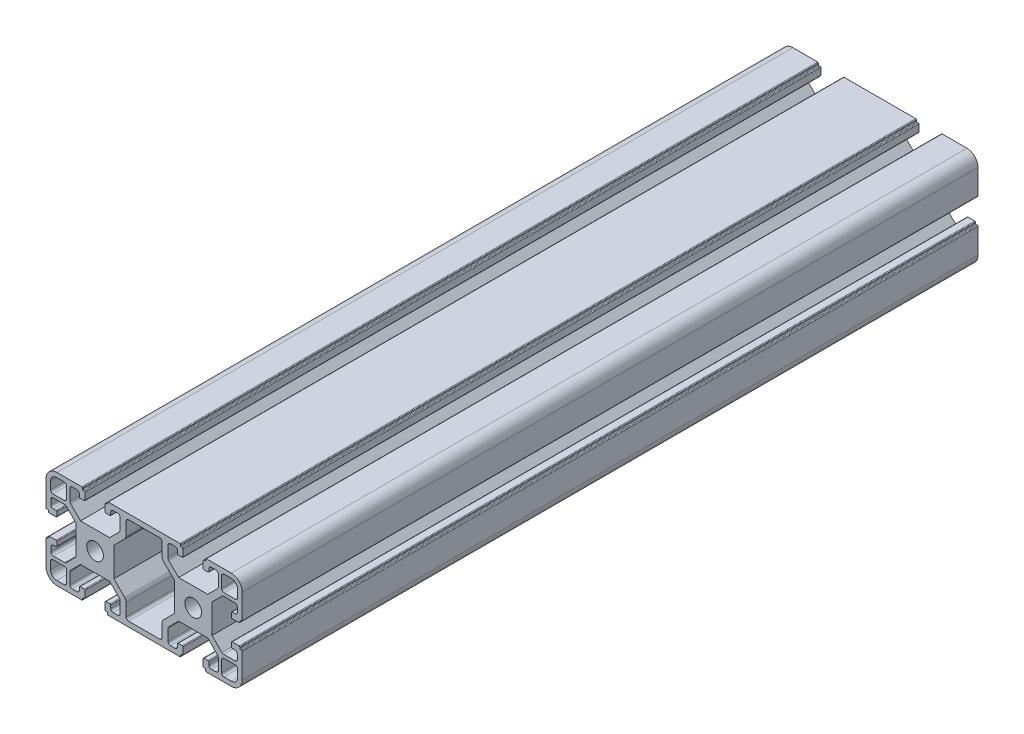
from build123d import *

# Parameters (mm, degrees)
MODEL_R         = 3.4
EXTRUDE_1_DEPTH = 300


with BuildPart() as part:
    # Model → Extrude 1 (new body)
    with BuildSketch(Plane.XY):
        with BuildLine():
            Line((2332.821808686, 1245.295370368), (2328.796934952, 1241.270496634))
            Line((2328.796934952, 1241.270496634), (2328.796934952, 1229.40603054))
            Line((2328.796934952, 1229.40603054), (2332.821808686, 1225.381156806))
            ThreePointArc((2332.821808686, 1225.381156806), (2333.146232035, 1225.164384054), (2333.528915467, 1225.088263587))
            Line((2333.528915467, 1225.088263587), (2338.096934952, 1225.088263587))
            ThreePointArc((2338.096934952, 1225.088263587), (2338.804041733, 1225.381156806), (2339.096934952, 1226.088263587))
            Line((2339.096934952, 1226.088263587), (2339.096934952, 1227.938263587))
            ThreePointArc((2339.096934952, 1227.938263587), (2338.804041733, 1228.645370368), (2338.096934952, 1228.938263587))
            Line((2338.096934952, 1228.938263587), (2336.996934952, 1228.938263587))
            ThreePointArc((2336.996934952, 1228.938263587), (2336.784802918, 1229.026131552), (2336.696934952, 1229.238263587))
            Line((2336.696934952, 1229.238263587), (2336.696934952, 1230.938263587))
            ThreePointArc((2336.696934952, 1230.938263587), (2336.784802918, 1231.150395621), (2336.996934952, 1231.238263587))
            Line((2336.996934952, 1231.238263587), (2339.796934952, 1231.238263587))
            ThreePointArc((2339.796934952, 1231.238263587), (2340.009066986, 1231.150395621), (2340.096934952, 1230.938263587))
            Line((2340.096934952, 1230.938263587), (2340.096934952, 1230.538263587))
            ThreePointArc((2340.096934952, 1230.538263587), (2340.184802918, 1230.326131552), (2340.396934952, 1230.238263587))
            Line((2340.396934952, 1230.238263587), (2340.796934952, 1230.238263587))
            ThreePointArc((2340.796934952, 1230.238263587), (2341.009066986, 1230.150395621), (2341.096934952, 1229.938263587))
            Line((2341.096934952, 1229.938263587), (2341.096934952, 1219.838263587))
            ThreePointArc((2341.096934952, 1219.838263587), (2339.778915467, 1216.656283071), (2336.596934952, 1215.338263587))
            Line((2336.596934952, 1215.338263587), (2326.496934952, 1215.338263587))
            ThreePointArc((2326.496934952, 1215.338263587), (2326.284802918, 1215.426131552), (2326.196934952, 1215.638263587))
            Line((2326.196934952, 1215.638263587), (2326.196934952, 1216.038263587))
            ThreePointArc((2326.196934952, 1216.038263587), (2326.109066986, 1216.250395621), (2325.896934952, 1216.338263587))
            Line((2325.896934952, 1216.338263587), (2325.496934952, 1216.338263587))
            ThreePointArc((2325.496934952, 1216.338263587), (2325.284802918, 1216.426131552), (2325.196934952, 1216.638263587))
            Line((2325.196934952, 1216.638263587), (2325.196934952, 1219.438263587))
            ThreePointArc((2325.196934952, 1219.438263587), (2325.284802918, 1219.650395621), (2325.496934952, 1219.738263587))
            Line((2325.496934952, 1219.738263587), (2327.196934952, 1219.738263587))
            ThreePointArc((2327.196934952, 1219.738263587), (2327.409066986, 1219.650395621), (2327.496934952, 1219.438263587))
            Line((2327.496934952, 1219.438263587), (2327.496934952, 1218.338263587))
            ThreePointArc((2327.496934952, 1218.338263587), (2327.789828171, 1217.631156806), (2328.496934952, 1217.338263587))
            Line((2328.496934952, 1217.338263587), (2330.346934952, 1217.338263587))
            ThreePointArc((2330.346934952, 1217.338263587), (2331.054041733, 1217.631156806), (2331.346934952, 1218.338263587))
            Line((2331.346934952, 1218.338263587), (2331.346934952, 1222.906283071))
            ThreePointArc((2331.346934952, 1222.906283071), (2331.270814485, 1223.288966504), (2331.054041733, 1223.613389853))
            Line((2331.054041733, 1223.613389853), (2327.029167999, 1227.638263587))
            Line((2327.029167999, 1227.638263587), (2315.164701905, 1227.638263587))
            Line((2315.164701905, 1227.638263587), (2311.139828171, 1223.613389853))
            ThreePointArc((2311.139828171, 1223.613389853), (2310.92305542, 1223.288966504), (2310.846934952, 1222.906283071))
            Line((2310.846934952, 1222.906283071), (2310.846934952, 1218.338263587))
            ThreePointArc((2310.846934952, 1218.338263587), (2311.139828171, 1217.631156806), (2311.846934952, 1217.338263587))
            Line((2311.846934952, 1217.338263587), (2313.696934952, 1217.338263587))
            ThreePointArc((2313.696934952, 1217.338263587), (2314.404041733, 1217.631156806), (2314.696934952, 1218.338263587))
            Line((2314.696934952, 1218.338263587), (2314.696934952, 1219.438263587))
            ThreePointArc((2314.696934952, 1219.438263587), (2314.784802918, 1219.650395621), (2314.996934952, 1219.738263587))
            Line((2314.996934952, 1219.738263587), (2316.696934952, 1219.738263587))
            ThreePointArc((2316.696934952, 1219.738263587), (2316.909066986, 1219.650395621), (2316.996934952, 1219.438263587))
            Line((2316.996934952, 1219.438263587), (2316.996934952, 1216.638263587))
            ThreePointArc((2316.996934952, 1216.638263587), (2316.909066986, 1216.426131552), (2316.696934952, 1216.338263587))
            Line((2316.696934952, 1216.338263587), (2316.296934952, 1216.338263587))
            ThreePointArc((2316.296934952, 1216.338263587), (2316.084802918, 1216.250395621), (2315.996934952, 1216.038263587))
            Line((2315.996934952, 1216.038263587), (2315.996934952, 1215.638263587))
            ThreePointArc((2315.996934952, 1215.638263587), (2315.909066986, 1215.426131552), (2315.696934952, 1215.338263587))
            Line((2315.696934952, 1215.338263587), (2286.496934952, 1215.338263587))
            ThreePointArc((2286.496934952, 1215.338263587), (2286.284802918, 1215.426131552), (2286.196934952, 1215.638263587))
            Line((2286.196934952, 1215.638263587), (2286.196934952, 1216.038263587))
            ThreePointArc((2286.196934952, 1216.038263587), (2286.109066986, 1216.250395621), (2285.896934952, 1216.338263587))
            Line((2285.896934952, 1216.338263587), (2285.496934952, 1216.338263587))
            ThreePointArc((2285.496934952, 1216.338263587), (2285.284802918, 1216.426131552), (2285.196934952, 1216.638263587))
            Line((2285.196934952, 1216.638263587), (2285.196934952, 1219.438263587))
            ThreePointArc((2285.196934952, 1219.438263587), (2285.284802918, 1219.650395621), (2285.496934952, 1219.738263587))
            Line((2285.496934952, 1219.738263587), (2287.196934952, 1219.738263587))
            ThreePointArc((2287.196934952, 1219.738263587), (2287.409066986, 1219.650395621), (2287.496934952, 1219.438263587))
            Line((2287.496934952, 1219.438263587), (2287.496934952, 1218.338263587))
            ThreePointArc((2287.496934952, 1218.338263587), (2287.789828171, 1217.631156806), (2288.496934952, 1217.338263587))
            Line((2288.496934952, 1217.338263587), (2290.346934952, 1217.338263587))
            ThreePointArc((2290.346934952, 1217.338263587), (2291.054041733, 1217.631156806), (2291.346934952, 1218.338263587))
            Line((2291.346934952, 1218.338263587), (2291.346934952, 1222.906283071))
            ThreePointArc((2291.346934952, 1222.906283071), (2291.270814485, 1223.288966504), (2291.054041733, 1223.613389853))
            Line((2291.054041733, 1223.613389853), (2287.029167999, 1227.638263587))
            Line((2287.029167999, 1227.638263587), (2275.164701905, 1227.638263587))
            Line((2275.164701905, 1227.638263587), (2271.139828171, 1223.613389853))
            ThreePointArc((2271.139828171, 1223.613389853), (2270.92305542, 1223.288966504), (2270.846934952, 1222.906283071))
            Line((2270.846934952, 1222.906283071), (2270.846934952, 1218.338263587))
            ThreePointArc((2270.846934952, 1218.338263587), (2271.139828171, 1217.631156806), (2271.846934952, 1217.338263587))
            Line((2271.846934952, 1217.338263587), (2273.696934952, 1217.338263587))
            ThreePointArc((2273.696934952, 1217.338263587), (2274.404041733, 1217.631156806), (2274.696934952, 1218.338263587))
            Line((2274.696934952, 1218.338263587), (2274.696934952, 1219.438263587))
            ThreePointArc((2274.696934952, 1219.438263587), (2274.784802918, 1219.650395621), (2274.996934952, 1219.738263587))
            Line((2274.996934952, 1219.738263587), (2276.696934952, 1219.738263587))
            ThreePointArc((2276.696934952, 1219.738263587), (2276.909066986, 1219.650395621), (2276.996934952, 1219.438263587))
            Line((2276.996934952, 1219.438263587), (2276.996934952, 1216.638263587))
            ThreePointArc((2276.996934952, 1216.638263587), (2276.909066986, 1216.426131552), (2276.696934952, 1216.338263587))
            Line((2276.696934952, 1216.338263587), (2276.296934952, 1216.338263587))
            ThreePointArc((2276.296934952, 1216.338263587), (2276.084802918, 1216.250395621), (2275.996934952, 1216.038263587))
            Line((2275.996934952, 1216.038263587), (2275.996934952, 1215.638263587))
            ThreePointArc((2275.996934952, 1215.638263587), (2275.909066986, 1215.426131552), (2275.696934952, 1215.338263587))
            Line((2275.696934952, 1215.338263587), (2265.596934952, 1215.338263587))
            ThreePointArc((2265.596934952, 1215.338263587), (2262.414954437, 1216.656283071), (2261.096934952, 1219.838263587))
            Line((2261.096934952, 1219.838263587), (2261.096934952, 1229.938263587))
            ThreePointArc((2261.096934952, 1229.938263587), (2261.184802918, 1230.150395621), (2261.396934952, 1230.238263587))
            Line((2261.396934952, 1230.238263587), (2261.796934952, 1230.238263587))
            ThreePointArc((2261.796934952, 1230.238263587), (2262.009066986, 1230.326131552), (2262.096934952, 1230.538263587))
            Line((2262.096934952, 1230.538263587), (2262.096934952, 1230.938263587))
            ThreePointArc((2262.096934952, 1230.938263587), (2262.184802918, 1231.150395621), (2262.396934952, 1231.238263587))
            Line((2262.396934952, 1231.238263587), (2265.196934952, 1231.238263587))
            ThreePointArc((2265.196934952, 1231.238263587), (2265.409066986, 1231.150395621), (2265.496934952, 1230.938263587))
            Line((2265.496934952, 1230.938263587), (2265.496934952, 1229.238263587))
            ThreePointArc((2265.496934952, 1229.238263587), (2265.409066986, 1229.026131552), (2265.196934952, 1228.938263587))
            Line((2265.196934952, 1228.938263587), (2264.096934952, 1228.938263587))
            ThreePointArc((2264.096934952, 1228.938263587), (2263.389828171, 1228.645370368), (2263.096934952, 1227.938263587))
            Line((2263.096934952, 1227.938263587), (2263.096934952, 1226.088263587))
            ThreePointArc((2263.096934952, 1226.088263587), (2263.389828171, 1225.381156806), (2264.096934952, 1225.088263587))
            Line((2264.096934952, 1225.088263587), (2268.664954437, 1225.088263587))
            ThreePointArc((2268.664954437, 1225.088263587), (2269.047637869, 1225.164384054), (2269.372061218, 1225.381156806))
            Line((2269.372061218, 1225.381156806), (2273.396934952, 1229.40603054))
            Line((2273.396934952, 1229.40603054), (2273.396934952, 1241.270496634))
            Line((2273.396934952, 1241.270496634), (2269.372061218, 1245.295370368))
            ThreePointArc((2269.372061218, 1245.295370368), (2269.047637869, 1245.512143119), (2268.664954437, 1245.588263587))
            Line((2268.664954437, 1245.588263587), (2264.096934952, 1245.588263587))
            ThreePointArc((2264.096934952, 1245.588263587), (2263.389828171, 1245.295370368), (2263.096934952, 1244.588263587))
            Line((2263.096934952, 1244.588263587), (2263.096934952, 1242.738263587))
            ThreePointArc((2263.096934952, 1242.738263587), (2263.389828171, 1242.031156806), (2264.096934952, 1241.738263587))
            Line((2264.096934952, 1241.738263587), (2265.196934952, 1241.738263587))
            ThreePointArc((2265.196934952, 1241.738263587), (2265.409066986, 1241.650395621), (2265.496934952, 1241.438263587))
            Line((2265.496934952, 1241.438263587), (2265.496934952, 1239.738263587))
            ThreePointArc((2265.496934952, 1239.738263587), (2265.409066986, 1239.526131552), (2265.196934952, 1239.438263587))
            Line((2265.196934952, 1239.438263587), (2262.396934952, 1239.438263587))
            ThreePointArc((2262.396934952, 1239.438263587), (2262.184802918, 1239.526131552), (2262.096934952, 1239.738263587))
            Line((2262.096934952, 1239.738263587), (2262.096934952, 1240.138263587))
            ThreePointArc((2262.096934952, 1240.138263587), (2262.009066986, 1240.350395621), (2261.796934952, 1240.438263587))
            Line((2261.796934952, 1240.438263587), (2261.396934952, 1240.438263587))
            ThreePointArc((2261.396934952, 1240.438263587), (2261.184802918, 1240.526131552), (2261.096934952, 1240.738263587))
            Line((2261.096934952, 1240.738263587), (2261.096934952, 1250.838263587))
            ThreePointArc((2261.096934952, 1250.838263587), (2262.414954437, 1254.020244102), (2265.596934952, 1255.338263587))
            Line((2265.596934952, 1255.338263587), (2275.696934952, 1255.338263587))
            ThreePointArc((2275.696934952, 1255.338263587), (2275.909066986, 1255.250395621), (2275.996934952, 1255.038263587))
            Line((2275.996934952, 1255.038263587), (2275.996934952, 1254.638263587))
            ThreePointArc((2275.996934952, 1254.638263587), (2276.084802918, 1254.426131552), (2276.296934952, 1254.338263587))
            Line((2276.296934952, 1254.338263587), (2276.696934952, 1254.338263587))
            ThreePointArc((2276.696934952, 1254.338263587), (2276.909066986, 1254.250395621), (2276.996934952, 1254.038263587))
            Line((2276.996934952, 1254.038263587), (2276.996934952, 1251.238263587))
            ThreePointArc((2276.996934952, 1251.238263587), (2276.909066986, 1251.026131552), (2276.696934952, 1250.938263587))
            Line((2276.696934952, 1250.938263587), (2274.996934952, 1250.938263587))
            ThreePointArc((2274.996934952, 1250.938263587), (2274.784802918, 1251.026131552), (2274.696934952, 1251.238263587))
            Line((2274.696934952, 1251.238263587), (2274.696934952, 1252.338263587))
            ThreePointArc((2274.696934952, 1252.338263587), (2274.404041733, 1253.045370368), (2273.696934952, 1253.338263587))
            Line((2273.696934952, 1253.338263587), (2271.846934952, 1253.338263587))
            ThreePointArc((2271.846934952, 1253.338263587), (2271.139828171, 1253.045370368), (2270.846934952, 1252.338263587))
            Line((2270.846934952, 1252.338263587), (2270.846934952, 1247.770244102))
            ThreePointArc((2270.846934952, 1247.770244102), (2270.92305542, 1247.38756067), (2271.139828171, 1247.063137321))
            Line((2271.139828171, 1247.063137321), (2275.164701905, 1243.038263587))
            Line((2275.164701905, 1243.038263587), (2287.029167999, 1243.038263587))
            Line((2287.029167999, 1243.038263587), (2291.054041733, 1247.063137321))
            ThreePointArc((2291.054041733, 1247.063137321), (2291.270814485, 1247.38756067), (2291.346934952, 1247.770244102))
            Line((2291.346934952, 1247.770244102), (2291.346934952, 1252.338263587))
            ThreePointArc((2291.346934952, 1252.338263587), (2291.054041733, 1253.045370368), (2290.346934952, 1253.338263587))
            Line((2290.346934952, 1253.338263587), (2288.496934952, 1253.338263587))
            ThreePointArc((2288.496934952, 1253.338263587), (2287.789828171, 1253.045370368), (2287.496934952, 1252.338263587))
            Line((2287.496934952, 1252.338263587), (2287.496934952, 1251.238263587))
            ThreePointArc((2287.496934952, 1251.238263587), (2287.409066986, 1251.026131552), (2287.196934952, 1250.938263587))
            Line((2287.196934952, 1250.938263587), (2285.496934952, 1250.938263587))
            ThreePointArc((2285.496934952, 1250.938263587), (2285.284802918, 1251.026131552), (2285.196934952, 1251.238263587))
            Line((2285.196934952, 1251.238263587), (2285.196934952, 1254.038263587))
            ThreePointArc((2285.196934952, 1254.038263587), (2285.284802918, 1254.250395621), (2285.496934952, 1254.338263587))
            Line((2285.496934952, 1254.338263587), (2285.896934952, 1254.338263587))
            ThreePointArc((2285.896934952, 1254.338263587), (2286.109066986, 1254.426131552), (2286.196934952, 1254.638263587))
            Line((2286.196934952, 1254.638263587), (2286.196934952, 1255.038263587))
            ThreePointArc((2286.196934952, 1255.038263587), (2286.284802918, 1255.250395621), (2286.496934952, 1255.338263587))
            Line((2286.496934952, 1255.338263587), (2315.696934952, 1255.338263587))
            ThreePointArc((2315.696934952, 1255.338263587), (2315.909066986, 1255.250395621), (2315.996934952, 1255.038263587))
            Line((2315.996934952, 1255.038263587), (2315.996934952, 1254.638263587))
            ThreePointArc((2315.996934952, 1254.638263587), (2316.084802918, 1254.426131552), (2316.296934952, 1254.338263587))
            Line((2316.296934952, 1254.338263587), (2316.696934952, 1254.338263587))
            ThreePointArc((2316.696934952, 1254.338263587), (2316.909066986, 1254.250395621), (2316.996934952, 1254.038263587))
            Line((2316.996934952, 1254.038263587), (2316.996934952, 1251.238263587))
            ThreePointArc((2316.996934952, 1251.238263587), (2316.909066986, 1251.026131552), (2316.696934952, 1250.938263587))
            Line((2316.696934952, 1250.938263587), (2314.996934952, 1250.938263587))
            ThreePointArc((2314.996934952, 1250.938263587), (2314.784802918, 1251.026131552), (2314.696934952, 1251.238263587))
            Line((2314.696934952, 1251.238263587), (2314.696934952, 1252.338263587))
            ThreePointArc((2314.696934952, 1252.338263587), (2314.404041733, 1253.045370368), (2313.696934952, 1253.338263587))
            Line((2313.696934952, 1253.338263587), (2311.846934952, 1253.338263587))
            ThreePointArc((2311.846934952, 1253.338263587), (2311.139828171, 1253.045370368), (2310.846934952, 1252.338263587))
            Line((2310.846934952, 1252.338263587), (2310.846934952, 1247.770244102))
            ThreePointArc((2310.846934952, 1247.770244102), (2310.92305542, 1247.38756067), (2311.139828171, 1247.063137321))
            Line((2311.139828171, 1247.063137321), (2315.164701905, 1243.038263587))
            Line((2315.164701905, 1243.038263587), (2327.029167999, 1243.038263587))
            Line((2327.029167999, 1243.038263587), (2331.054041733, 1247.063137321))
            ThreePointArc((2331.054041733, 1247.063137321), (2331.270814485, 1247.38756067), (2331.346934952, 1247.770244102))
            Line((2331.346934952, 1247.770244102), (2331.346934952, 1252.338263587))
            ThreePointArc((2331.346934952, 1252.338263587), (2331.054041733, 1253.045370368), (2330.346934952, 1253.338263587))
            Line((2330.346934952, 1253.338263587), (2328.496934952, 1253.338263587))
            ThreePointArc((2328.496934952, 1253.338263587), (2327.789828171, 1253.045370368), (2327.496934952, 1252.338263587))
            Line((2327.496934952, 1252.338263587), (2327.496934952, 1251.238263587))
            ThreePointArc((2327.496934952, 1251.238263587), (2327.409066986, 1251.026131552), (2327.196934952, 1250.938263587))
            Line((2327.196934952, 1250.938263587), (2325.496934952, 1250.938263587))
            ThreePointArc((2325.496934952, 1250.938263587), (2325.284802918, 1251.026131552), (2325.196934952, 1251.238263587))
            Line((2325.196934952, 1251.238263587), (2325.196934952, 1254.038263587))
            ThreePointArc((2325.196934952, 1254.038263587), (2325.284802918, 1254.250395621), (2325.496934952, 1254.338263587))
            Line((2325.496934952, 1254.338263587), (2325.896934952, 1254.338263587))
            ThreePointArc((2325.896934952, 1254.338263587), (2326.109066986, 1254.426131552), (2326.196934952, 1254.638263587))
            Line((2326.196934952, 1254.638263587), (2326.196934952, 1255.038263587))
            ThreePointArc((2326.196934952, 1255.038263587), (2326.284802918, 1255.250395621), (2326.496934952, 1255.338263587))
            Line((2326.496934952, 1255.338263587), (2336.596934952, 1255.338263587))
            ThreePointArc((2336.596934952, 1255.338263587), (2339.778915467, 1254.020244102), (2341.096934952, 1250.838263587))
            Line((2341.096934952, 1250.838263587), (2341.096934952, 1240.738263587))
            ThreePointArc((2341.096934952, 1240.738263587), (2341.009066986, 1240.526131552), (2340.796934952, 1240.438263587))
            Line((2340.796934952, 1240.438263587), (2340.396934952, 1240.438263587))
            ThreePointArc((2340.396934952, 1240.438263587), (2340.184802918, 1240.350395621), (2340.096934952, 1240.138263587))
            Line((2340.096934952, 1240.138263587), (2340.096934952, 1239.738263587))
            ThreePointArc((2340.096934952, 1239.738263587), (2340.009066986, 1239.526131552), (2339.796934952, 1239.438263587))
            Line((2339.796934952, 1239.438263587), (2336.996934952, 1239.438263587))
            ThreePointArc((2336.996934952, 1239.438263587), (2336.784802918, 1239.526131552), (2336.696934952, 1239.738263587))
            Line((2336.696934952, 1239.738263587), (2336.696934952, 1241.438263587))
            ThreePointArc((2336.696934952, 1241.438263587), (2336.784802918, 1241.650395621), (2336.996934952, 1241.738263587))
            Line((2336.996934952, 1241.738263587), (2338.096934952, 1241.738263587))
            ThreePointArc((2338.096934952, 1241.738263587), (2338.804041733, 1242.031156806), (2339.096934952, 1242.738263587))
            Line((2339.096934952, 1242.738263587), (2339.096934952, 1244.588263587))
            ThreePointArc((2339.096934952, 1244.588263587), (2338.804041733, 1245.295370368), (2338.096934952, 1245.588263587))
            Line((2338.096934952, 1245.588263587), (2333.528915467, 1245.588263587))
            ThreePointArc((2333.528915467, 1245.588263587), (2333.146232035, 1245.512143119), (2332.821808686, 1245.295370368))
        make_face()
        with Locations((2321.096934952, 1235.338263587)):
            Circle(MODEL_R, mode=Mode.SUBTRACT)
        with Locations((2281.096934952, 1235.338263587)):
            Circle(MODEL_R, mode=Mode.SUBTRACT)
        with BuildLine():
            Line((2307.446934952, 1217.438263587), (2294.746934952, 1217.438263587))
            ThreePointArc((2294.746934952, 1217.438263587), (2294.039828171, 1217.731156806), (2293.746934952, 1218.438263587))
            Line((2293.746934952, 1218.438263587), (2293.746934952, 1223.627603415))
            ThreePointArc((2293.746934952, 1223.627603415), (2293.594694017, 1224.39297028), (2293.161148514, 1225.041816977))
            Line((2293.161148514, 1225.041816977), (2288.796934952, 1229.40603054))
            Line((2288.796934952, 1229.40603054), (2288.796934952, 1241.270496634))
            Line((2288.796934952, 1241.270496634), (2293.161148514, 1245.634710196))
            ThreePointArc((2293.161148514, 1245.634710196), (2293.594694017, 1246.283556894), (2293.746934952, 1247.048923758))
            Line((2293.746934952, 1247.048923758), (2293.746934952, 1252.238263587))
            ThreePointArc((2293.746934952, 1252.238263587), (2294.039828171, 1252.945370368), (2294.746934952, 1253.238263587))
            Line((2294.746934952, 1253.238263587), (2307.446934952, 1253.238263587))
            ThreePointArc((2307.446934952, 1253.238263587), (2308.154041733, 1252.945370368), (2308.446934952, 1252.238263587))
            Line((2308.446934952, 1252.238263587), (2308.446934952, 1247.048923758))
            ThreePointArc((2308.446934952, 1247.048923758), (2308.599175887, 1246.283556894), (2309.03272139, 1245.634710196))
            Line((2309.03272139, 1245.634710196), (2313.396934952, 1241.270496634))
            Line((2313.396934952, 1241.270496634), (2313.396934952, 1229.40603054))
            Line((2313.396934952, 1229.40603054), (2309.03272139, 1225.041816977))
            ThreePointArc((2309.03272139, 1225.041816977), (2308.599175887, 1224.39297028), (2308.446934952, 1223.627603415))
            Line((2308.446934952, 1223.627603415), (2308.446934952, 1218.438263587))
            ThreePointArc((2308.446934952, 1218.438263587), (2308.154041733, 1217.731156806), (2307.446934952, 1217.438263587))
        make_face(mode=Mode.SUBTRACT)
        with BuildLine():
            Line((2268.496934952, 1253.488263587), (2265.446934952, 1253.488263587))
            ThreePointArc((2265.446934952, 1253.488263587), (2263.679167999, 1252.75603054), (2262.946934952, 1250.988263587))
            Line((2262.946934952, 1250.988263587), (2262.946934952, 1247.938263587))
            ThreePointArc((2262.946934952, 1247.938263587), (2263.239828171, 1247.231156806), (2263.946934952, 1246.938263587))
            Line((2263.946934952, 1246.938263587), (2268.496934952, 1246.938263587))
            ThreePointArc((2268.496934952, 1246.938263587), (2269.204041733, 1247.231156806), (2269.496934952, 1247.938263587))
            Line((2269.496934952, 1247.938263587), (2269.496934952, 1252.488263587))
            ThreePointArc((2269.496934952, 1252.488263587), (2269.204041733, 1253.195370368), (2268.496934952, 1253.488263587))
        make_face(mode=Mode.SUBTRACT)
        with BuildLine():
            Line((2265.446934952, 1217.188263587), (2268.496934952, 1217.188263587))
            ThreePointArc((2268.496934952, 1217.188263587), (2269.204041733, 1217.481156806), (2269.496934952, 1218.188263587))
            Line((2269.496934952, 1218.188263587), (2269.496934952, 1222.738263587))
            ThreePointArc((2269.496934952, 1222.738263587), (2269.204041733, 1223.445370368), (2268.496934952, 1223.738263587))
            Line((2268.496934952, 1223.738263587), (2263.946934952, 1223.738263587))
            ThreePointArc((2263.946934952, 1223.738263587), (2263.239828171, 1223.445370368), (2262.946934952, 1222.738263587))
            Line((2262.946934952, 1222.738263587), (2262.946934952, 1219.688263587))
            ThreePointArc((2262.946934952, 1219.688263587), (2263.679167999, 1217.920496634), (2265.446934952, 1217.188263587))
        make_face(mode=Mode.SUBTRACT)
        with BuildLine():
            Line((2333.696934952, 1253.488263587), (2336.746934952, 1253.488263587))
            ThreePointArc((2336.746934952, 1253.488263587), (2338.514701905, 1252.75603054), (2339.246934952, 1250.988263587))
            Line((2339.246934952, 1250.988263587), (2339.246934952, 1247.938263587))
            ThreePointArc((2339.246934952, 1247.938263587), (2338.954041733, 1247.231156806), (2338.246934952, 1246.938263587))
            Line((2338.246934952, 1246.938263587), (2333.696934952, 1246.938263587))
            ThreePointArc((2333.696934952, 1246.938263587), (2332.989828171, 1247.231156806), (2332.696934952, 1247.938263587))
            Line((2332.696934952, 1247.938263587), (2332.696934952, 1252.488263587))
            ThreePointArc((2332.696934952, 1252.488263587), (2332.989828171, 1253.195370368), (2333.696934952, 1253.488263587))
        make_face(mode=Mode.SUBTRACT)
        with BuildLine():
            Line((2336.746934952, 1217.188263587), (2333.696934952, 1217.188263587))
            ThreePointArc((2333.696934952, 1217.188263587), (2332.989828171, 1217.481156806), (2332.696934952, 1218.188263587))
            Line((2332.696934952, 1218.188263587), (2332.696934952, 1222.738263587))
            ThreePointArc((2332.696934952, 1222.738263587), (2332.989828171, 1223.445370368), (2333.696934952, 1223.738263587))
            Line((2333.696934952, 1223.738263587), (2338.246934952, 1223.738263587))
            ThreePointArc((2338.246934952, 1223.738263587), (2338.954041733, 1223.445370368), (2339.246934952, 1222.738263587))
            Line((2339.246934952, 1222.738263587), (2339.246934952, 1219.688263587))
            ThreePointArc((2339.246934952, 1219.688263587), (2338.514701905, 1217.920496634), (2336.746934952, 1217.188263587))
        make_face(mode=Mode.SUBTRACT)
    extrude(amount=EXTRUDE_1_DEPTH)


solid = part.part
